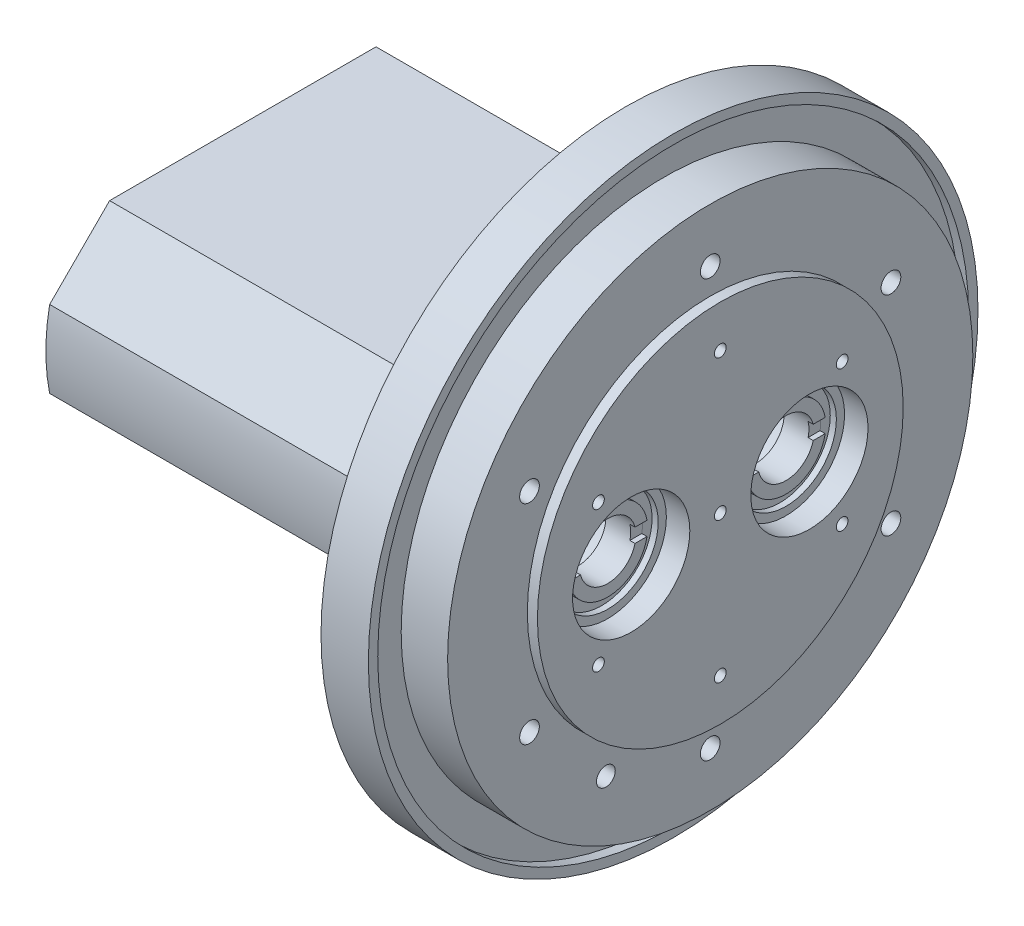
from build123d import *

# Parameters (mm, degrees)
LINEAR_AUSTRAGEN1_DEPTH            = 81.67
SKIZZE3_R                          = 13
LINEAR_AUSTRAGEN2_DEPTH            = 90.42
KREISMUSTER1_COUNT                 = 6
KREISMUSTER2_COUNT                 = 4
KREISMUSTER3_COUNT                 = 4
LINEAR_AUSTRAGEN3_REACH            = 139.176
SKIZZE12_R                         = 6
SKIZZE14_R                         = 12.5
LINEAR_AUSTRAGEN4_DEPTH            = 5
SKIZZE15_R                         = 10.75
SKIZZE15_R_2                       = 8.5
LINEAR_AUSTRAGEN5_DEPTH            = 1.3
LINEAR_AUSTRAGEN7_DEPTH            = 1.1
KREISMUSTER4_COUNT                 = 6
M3_GEWINDEBOHRUNG4_D               = 2.5
M3_GEWINDEBOHRUNG4_DEPTH           = 10.5
M3_GEWINDEBOHRUNG4_TIP             = 0.751075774
LINEAR_START                       = -59
LINEAR_AUSTRAGEN8_DEPTH            = 20
VERRUNDUNG1_R                      = 6
LINEAR_AUSTRAGEN9_DEPTH            = 81.67
M3_GEWINDEBOHRUNG5_D               = 2.5
M3_GEWINDEBOHRUNG6_D               = 2.5
M3_GEWINDEBOHRUNG7_D               = 2.5
M3_GEWINDEBOHRUNG8_D               = 2.5
LINEAR_AUSTRAGEN10_REACH           = 150.285
SKIZZE34_R                         = 0.6
F_4_0_4_DURCHMESSER_BOHRUNG1_D     = 4
F_4_0_4_DURCHMESSER_BOHRUNG1_DEPTH = 5
F_4_0_4_DURCHMESSER_BOHRUNG1_TIP   = 1.201721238


with BuildPart() as part:
    # Skizze1 → Rotation1 (revolve)
    with BuildSketch(Plane.XY, mode=Mode.PRIVATE) as rotation1_sk:
        Polygon((0, 0), (0, 39), (-2.15, 39), (-2.15, 56), (-12.05, 56), (-12.05, 63), (-10.05, 63), (-10.05, 65), (-20.15, 65), (-20.15, 42), (-101.82, 42), (-101.82, 0), align=None)
    revolve(rotation1_sk.sketch.rotate(Axis((0, 0, 0), (1, 0, 0)), 90), axis=Axis((0, 0, 0), (1, 0, 0)))

    # Skizze2 → Linear austragen1 (cut)
    with BuildSketch(Plane.ZY.offset(101.82)):
        with BuildLine():
            Line((-36.373066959, 21), (36.373066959, 21))
            ThreePointArc((36.373066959, 21), (0, 42), (-36.373066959, 21))
        make_face()
        with BuildLine():
            Line((-36.373066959, -21), (36.373066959, -21))
            ThreePointArc((36.373066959, -21), (0, -42), (-36.373066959, -21))
        make_face()
    extrude(amount=-LINEAR_AUSTRAGEN1_DEPTH, mode=Mode.SUBTRACT)

    # Skizze3 → Linear austragen2 (cut)
    with BuildSketch(Plane.ZY.offset(101.82)):
        with Locations((-19, 0)):
            Circle(SKIZZE3_R)
        with Locations((19, 0)):
            Circle(SKIZZE3_R)
    extrude(amount=-LINEAR_AUSTRAGEN2_DEPTH, mode=Mode.SUBTRACT)

    # Skizze4 → Schnitt-Rotation1 (revolve, cut)
    with BuildSketch(Plane.XY, mode=Mode.PRIVATE) as schnitt_rotation1_sk:
        Polygon((-20.15, 51.1), (-16.15, 51.1), (-16.15, 47), (-18.2, 47), (-18.2, 42), (-20.15, 42), align=None)
    revolve(schnitt_rotation1_sk.sketch.rotate(Axis((0, 0, 0), (-1, 0, 0)), 90), axis=Axis((0, 0, 0), (-1, 0, 0)), mode=Mode.SUBTRACT)

    # Skizze6 → M5 Gewindebohrung1 (revolve, cut)
    with BuildSketch(Plane(origin=(-2.15, 44.5, 0), x_dir=(0, 0, -1), z_dir=(0, 1, 0))):
        Polygon((0, 0), (0, 13.2618073), (2.1, 12), (2.1, 0), align=None)
    m5_gewindebohrung1 = revolve(axis=Axis((4.2, 44.5, 0), (-1, 0, 0)), mode=Mode.SUBTRACT)

    # Kreismuster1: M5 Gewindebohrung1 ×6 about axis
    kreismuster1_axis = Axis((0, 0, 0), (1, 0, 0))
    for i in range(1, KREISMUSTER1_COUNT):
        add(m5_gewindebohrung1.rotate(kreismuster1_axis, i * 360 / KREISMUSTER1_COUNT), mode=Mode.SUBTRACT)

    # Skizze8 → M3 Gewindebohrung1 (revolve, cut)
    with BuildSketch(Plane(origin=(-101.82, 0, -35.15), x_dir=(0, 0, 1), z_dir=(0, 1, 0))):
        Polygon((0, 0), (0, 9.251075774), (1.25, 8.5), (1.25, 0), align=None)
    m3_gewindebohrung1 = revolve(axis=Axis((-108.17, 0, -35.15), (1, 0, 0)), mode=Mode.SUBTRACT)

    # Kreismuster2: M3 Gewindebohrung1 ×4 about axis
    kreismuster2_axis = Axis((0, 0, -19), (1, 0, 0))
    for i in range(1, KREISMUSTER2_COUNT):
        add(m3_gewindebohrung1.rotate(kreismuster2_axis, i * 360 / KREISMUSTER2_COUNT), mode=Mode.SUBTRACT)

    # Skizze10 → M3 Gewindebohrung2 (revolve, cut)
    with BuildSketch(Plane(origin=(-101.82, 0, 35.15), x_dir=(0, 0, 1), z_dir=(0, 1, 0))):
        Polygon((0, 0), (0, 9.251075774), (1.25, 8.5), (1.25, 0), align=None)
    m3_gewindebohrung2 = revolve(axis=Axis((-108.17, 0, 35.15), (1, 0, 0)), mode=Mode.SUBTRACT)

    # Kreismuster3: M3 Gewindebohrung2 ×4 about axis
    kreismuster3_axis = Axis((0, 0, 19), (1, 0, 0))
    for i in range(1, KREISMUSTER3_COUNT):
        add(m3_gewindebohrung2.rotate(kreismuster3_axis, i * 360 / KREISMUSTER3_COUNT), mode=Mode.SUBTRACT)

    # Skizze12 → Linear austragen3 (cut, up to next)
    with BuildSketch(Plane(origin=(0, 0, 0), x_dir=(0, 0, -1), z_dir=(1, 0, 0)), mode=Mode.PRIVATE) as linear_austragen3_sk1:
        with Locations((-19, 0)):
            Circle(SKIZZE12_R)
    linear_austragen3_tool1 = extrude(linear_austragen3_sk1.sketch, amount=-LINEAR_AUSTRAGEN3_REACH, mode=Mode.PRIVATE) & part.part
    # Skizze12 → Linear austragen3 (cut, up to next)
    with BuildSketch(Plane(origin=(0, 0, 0), x_dir=(0, 0, -1), z_dir=(1, 0, 0)), mode=Mode.PRIVATE) as linear_austragen3_sk2:
        with Locations((19, 0)):
            Circle(SKIZZE12_R)
    linear_austragen3_tool2 = extrude(linear_austragen3_sk2.sketch, amount=-LINEAR_AUSTRAGEN3_REACH, mode=Mode.PRIVATE) & part.part
    add(linear_austragen3_tool1.solids().sort_by_distance((0, 0, 19))[0], mode=Mode.SUBTRACT)
    add(linear_austragen3_tool2.solids().sort_by_distance((0, 0, -19))[0], mode=Mode.SUBTRACT)

    # Skizze14 → Linear austragen4 (cut)
    with BuildSketch(Plane(origin=(0, 0, 0), x_dir=(0, 0, -1), z_dir=(1, 0, 0))):
        with Locations((-19, 0)):
            Circle(SKIZZE14_R)
        with Locations((19, 0)):
            Circle(SKIZZE14_R)
    extrude(amount=-LINEAR_AUSTRAGEN4_DEPTH, mode=Mode.SUBTRACT)

    # Skizze15 → Linear austragen5 (cut)
    # profile 1 of 2: a face of its own
    with BuildSketch(Plane(origin=(-5, 0, 0), x_dir=(0, 0, -1), z_dir=(1, 0, 0))):
        with Locations((-19, 0)):
            Circle(SKIZZE15_R)
        with Locations((-19, 0)):
            Circle(SKIZZE15_R_2, mode=Mode.SUBTRACT)
    # profile 2 of 2: a face of its own
    with BuildSketch(Plane(origin=(-5, 0, 0), x_dir=(0, 0, -1), z_dir=(1, 0, 0))):
        with Locations((19, 0)):
            Circle(SKIZZE15_R)
        with Locations((19, 0)):
            Circle(SKIZZE15_R_2, mode=Mode.SUBTRACT)
    extrude(amount=-LINEAR_AUSTRAGEN5_DEPTH, mode=Mode.SUBTRACT)

    # Skizze17 → Linear austragen7 (cut)
    with BuildSketch(Plane(origin=(-5, 0, 0), x_dir=(0, 0, -1), z_dir=(1, 0, 0))):
        with BuildLine():
            Line((-27.366600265, -1.5), (-10.633399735, -1.5))
            ThreePointArc((-10.633399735, -1.5), (-10.5, 0), (-10.633399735, 1.5))
            Line((-10.633399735, 1.5), (-27.366600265, 1.5))
            ThreePointArc((-27.366600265, 1.5), (-27.5, 0), (-27.366600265, -1.5))
        make_face()
        with BuildLine():
            Line((10.633399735, -1.5), (27.366600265, -1.5))
            ThreePointArc((27.366600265, -1.5), (27.5, 0), (27.366600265, 1.5))
            Line((27.366600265, 1.5), (10.633399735, 1.5))
            ThreePointArc((10.633399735, 1.5), (10.5, 0), (10.633399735, -1.5))
        make_face()
    extrude(amount=-LINEAR_AUSTRAGEN7_DEPTH, mode=Mode.SUBTRACT)

    # Skizze18 → M3 Gewindebohrung3 (revolve, cut)
    with BuildSketch(Plane(origin=(0, 30, 0), x_dir=(0, 0, -1), z_dir=(0, 1, 0))):
        Polygon((0, 0), (0, 11.251075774), (1.25, 10.5), (1.25, 0), align=None)
    m3_gewindebohrung3 = revolve(axis=Axis((6.35, 30, 0), (-1, 0, 0)), mode=Mode.SUBTRACT)

    # Kreismuster4: M3 Gewindebohrung3 ×6 about axis
    kreismuster4_axis = Axis((0, 0, 0), (1, 0, 0))
    for i in range(1, KREISMUSTER4_COUNT):
        add(m3_gewindebohrung3.rotate(kreismuster4_axis, i * 360 / KREISMUSTER4_COUNT), mode=Mode.SUBTRACT)

    # M3 Gewindebohrung4
    with Locations(Plane(origin=(0, 0, 0), x_dir=(0, 0, -1), z_dir=(1, 0, 0))):
        with Locations((0, 0)):
            Hole(M3_GEWINDEBOHRUNG4_D / 2, depth=M3_GEWINDEBOHRUNG4_DEPTH)
            with Locations((0, 0, -(M3_GEWINDEBOHRUNG4_DEPTH + M3_GEWINDEBOHRUNG4_TIP / 2))):  # 118° drill point
                Cone(0, M3_GEWINDEBOHRUNG4_D / 2, M3_GEWINDEBOHRUNG4_TIP, mode=Mode.SUBTRACT)

    # Skizze22 → Linear austragen8 (cut)
    with BuildSketch(Plane.ZY.offset(101.82).offset(LINEAR_START)):
        Polygon((-10.606601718, 21), (0, 10.393398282), (10.606601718, 21), align=None)
        Polygon((-10.606601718, -21), (0, -10.393398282), (10.606601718, -21), align=None)
    extrude(amount=-LINEAR_AUSTRAGEN8_DEPTH, mode=Mode.SUBTRACT)

    # Verrundung1
    verrundung1_edges = [part.edges().sort_by_distance(p)[0] for p in [
        (-22.82, 15.696699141, -5.303300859),
        (-42.82, 15.696699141, -5.303300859),
        (-22.82, -15.696699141, 5.303300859),
        (-42.82, -15.696699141, 5.303300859),
    ]]
    fillet(verrundung1_edges, radius=VERRUNDUNG1_R)

    # Skizze23 → Linear austragen9 (cut)
    with BuildSketch(Plane.ZY.offset(101.82)):
        with BuildLine():
            Line((-28.405591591, -21), (-41.18830094, -8.217290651))
            ThreePointArc((-41.18830094, -8.217290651), (-39.303827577, -14.805713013), (-36.373066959, -21))
            Line((-36.373066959, -21), (-28.405591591, -21))
        make_face()
        with BuildLine():
            Line((-28.405591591, 21), (-41.18830094, 8.217290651))
            ThreePointArc((-41.18830094, 8.217290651), (-39.303827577, 14.805713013), (-36.373066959, 21))
            Line((-36.373066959, 21), (-28.405591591, 21))
        make_face()
        with BuildLine():
            Line((28.405591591, 21), (41.18830094, 8.217290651))
            ThreePointArc((41.18830094, 8.217290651), (39.303827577, 14.805713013), (36.373066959, 21))
            Line((36.373066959, 21), (28.405591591, 21))
        make_face()
        with BuildLine():
            Line((28.405591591, -21), (41.18830094, -8.217290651))
            ThreePointArc((41.18830094, -8.217290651), (39.303827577, -14.805713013), (36.373066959, -21))
            Line((36.373066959, -21), (28.405591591, -21))
        make_face()
    extrude(amount=-LINEAR_AUSTRAGEN9_DEPTH, mode=Mode.SUBTRACT)

    # M3 Gewindebohrung5 (through all)
    with Locations(Plane(origin=(0, 5.196699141, -5.196699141), x_dir=(-1, 0, 0), z_dir=(0, 0.7071067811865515, -0.7071067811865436))):
        with Locations((32.82, 13.435028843)):
            Hole(M3_GEWINDEBOHRUNG5_D / 2)

    # M3 Gewindebohrung6 (through all)
    with Locations(Plane(origin=(0, 5.196699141, 5.196699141), x_dir=(1, 0, 0), z_dir=(0, 0.7071067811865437, 0.7071067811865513))):
        with Locations((-32.82, 13.435028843)):
            Hole(M3_GEWINDEBOHRUNG6_D / 2)

    # M3 Gewindebohrung7 (through all)
    with Locations(Plane(origin=(0, -5.196699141, -5.196699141), x_dir=(-1, 0, 0), z_dir=(0, -0.7071067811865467, -0.7071067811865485))):
        with Locations((32.82, -13.435028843)):
            Hole(M3_GEWINDEBOHRUNG7_D / 2)

    # M3 Gewindebohrung8 (through all)
    with Locations(Plane(origin=(0, -5.196699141, 5.196699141), x_dir=(1, 0, 0), z_dir=(0, -0.7071067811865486, 0.7071067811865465))):
        with Locations((-32.82, -13.435028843)):
            Hole(M3_GEWINDEBOHRUNG8_D / 2)

    # Skizze34 → Linear austragen10 (cut, up to next)
    with BuildSketch(Plane(origin=(0, -21, 0), x_dir=(1, 0, 0), z_dir=(0, 1, 0)), mode=Mode.PRIVATE) as linear_austragen10_sk1:
        with Locations(Location((-81.82, 19, 0), (0, 0, 90))):
            Circle(SKIZZE34_R)
    linear_austragen10_tool1 = extrude(linear_austragen10_sk1.sketch, amount=LINEAR_AUSTRAGEN10_REACH, mode=Mode.PRIVATE) & part.part
    # Skizze34 → Linear austragen10 (cut, up to next)
    with BuildSketch(Plane(origin=(0, -21, 0), x_dir=(1, 0, 0), z_dir=(0, 1, 0)), mode=Mode.PRIVATE) as linear_austragen10_sk2:
        with Locations(Location((-81.82, -19, 0), (0, 0, 90))):
            Circle(SKIZZE34_R)
    linear_austragen10_tool2 = extrude(linear_austragen10_sk2.sketch, amount=LINEAR_AUSTRAGEN10_REACH, mode=Mode.PRIVATE) & part.part
    add(linear_austragen10_tool1.solids().sort_by_distance((-81.82, -21, -19))[0], mode=Mode.SUBTRACT)
    add(linear_austragen10_tool2.solids().sort_by_distance((-81.82, -21, 19))[0], mode=Mode.SUBTRACT)

    # 4.0 _4_ Durchmesser Bohrung1
    with Locations(Plane(origin=(-2.15, 0, 0), x_dir=(0, 0, -1), z_dir=(1, 0, 0))):
        with Locations((-22.25, -38.538130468)):
            Hole(F_4_0_4_DURCHMESSER_BOHRUNG1_D / 2, depth=F_4_0_4_DURCHMESSER_BOHRUNG1_DEPTH)
            with Locations((0, 0, -(F_4_0_4_DURCHMESSER_BOHRUNG1_DEPTH + F_4_0_4_DURCHMESSER_BOHRUNG1_TIP / 2))):  # 118° drill point
                Cone(0, F_4_0_4_DURCHMESSER_BOHRUNG1_D / 2, F_4_0_4_DURCHMESSER_BOHRUNG1_TIP, mode=Mode.SUBTRACT)


solid = part.part
